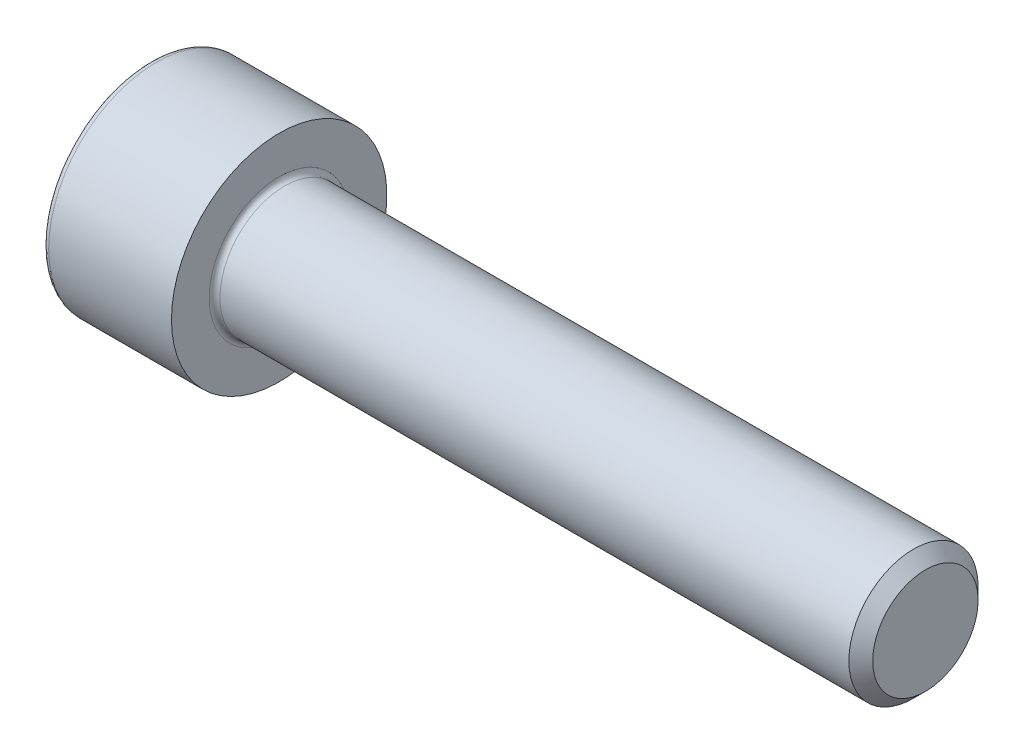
from build123d import *

# Parameters (mm, degrees)
FILLET1_R   = 0.25
FILLET2_R   = 0.3
HEX_2_DEPTH = 3


with BuildPart() as part:
    # BodySke → Base-Revolve (revolve)
    with BuildSketch(Plane.XY, mode=Mode.PRIVATE) as base_revolve_sk:
        Polygon((0, 0), (0, 5), (6, 5), (6, 3), (35.4455, 3), (36, 2.4455), (36, 0), align=None)
    revolve(base_revolve_sk.sketch.rotate(Axis((-31.75, 0, 0), (1, 0, 0)), 90), axis=Axis((-31.75, 0, 0), (1, 0, 0)))

    # Fillet1
    fillet1_edges = [part.edges().sort_by_distance(p)[0] for p in [
        (6, 0, -3),
    ]]
    fillet(fillet1_edges, radius=FILLET1_R)

    # Fillet2
    fillet2_edges = [part.edges().sort_by_distance(p)[0] for p in [
        (0, 0, -5),
    ]]
    fillet(fillet2_edges, radius=FILLET2_R)

    # Sketch2 → Hex-PreBroach (revolve, cut)
    with BuildSketch(Plane.XY, mode=Mode.PRIVATE) as hex_prebroach_sk:
        Polygon((0, 2.542), (3, 2.542), (4.467624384, 0), (0, 0), align=None)
    revolve(hex_prebroach_sk.sketch.rotate(Axis((0, 0, 0), (1, 0, 0)), 90), axis=Axis((0, 0, 0), (1, 0, 0)), mode=Mode.SUBTRACT)

    # Sketch3 → Hex 2 (cut)
    with BuildSketch(Plane(origin=(0, 0, 0), x_dir=(0, 0.500000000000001, 0.866025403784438), z_dir=(-1, 0, 0))):
        Polygon((1.467624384, 2.542), (-1.467624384, 2.542), (-2.935248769, 0), (-1.467624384, -2.542), (1.467624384, -2.542), (2.935248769, 0), align=None)
    extrude(amount=-HEX_2_DEPTH, mode=Mode.SUBTRACT)


solid = part.part
